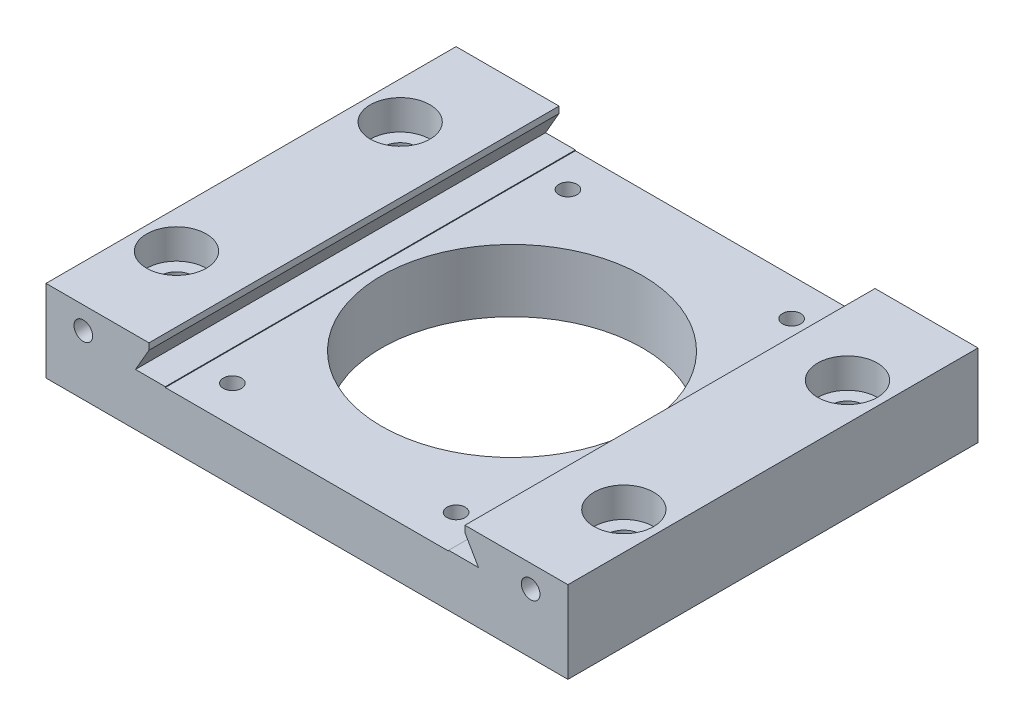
from build123d import *

# Parameters (mm, degrees)
BOSS_EXTRUDE1_DEPTH            = 35
CUT_EXTRUDE1_DEPTH             = 67.113538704
SKETCH4_W                      = 38
SKETCH4_H                      = 55
CUT_EXTRUDE3_DEPTH             = 0.1
CUT_EXTRUDE7_DEPTH             = 4.5
MIRROR2_COPY_1_DEPTH           = 4.5
SKETCH27_R                     = 19.5
BOSS_EXTRUDE2_DEPTH            = 1.5
SKETCH28_R                     = 17.5
CUT_EXTRUDE8_DEPTH             = 47.233105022
CBORE_FOR_M4_SHCS1_D           = 4.5
CBORE_FOR_M4_SHCS1_CBORE_D     = 8
CBORE_FOR_M4_SHCS1_CBORE_DEPTH = 4
CUT_EXTRUDE9_DEPTH             = 67.113538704
M3X0_5_TAPPED_HOLE2_D          = 2.5
M3X0_5_TAPPED_HOLE2_DEPTH      = 7.5
M3X0_5_TAPPED_HOLE2_TIP        = 0.751075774


with BuildPart() as part:
    # Sketch1 → Boss-Extrude1 (new, symmetric)
    with BuildSketch(Plane(origin=(0, 0, 0), x_dir=(0, 0, -1), z_dir=(1, 0, 0))):
        Polygon((0, 0), (27.5, 0), (27.5, 11), (-27.5, 11), (-27.5, 0), align=None)
    extrude(amount=BOSS_EXTRUDE1_DEPTH, both=True)

    # Sketch2 → Cut-Extrude1 (cut, through all)
    with BuildSketch(Plane.XY.offset(27.5)):
        Polygon((-20.690598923, 11), (-23, 7), (0, 7), (23, 7), (20.690598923, 11), align=None)
    extrude(amount=-CUT_EXTRUDE1_DEPTH, mode=Mode.SUBTRACT)

    # Sketch4 → Cut-Extrude3 (cut)
    with BuildSketch(Plane(origin=(0, 7, 0), x_dir=(1, 0, 0), z_dir=(0, 1, 0))):
        Rectangle(SKETCH4_W, SKETCH4_H)
    extrude(amount=-CUT_EXTRUDE3_DEPTH, mode=Mode.SUBTRACT)

    # Sketch11 → Cut-Extrude7 (cut)
    with BuildSketch(Plane.XZ):
        with BuildLine():
            Line((-13, 19.5), (-26, 19.5))
            ThreePointArc((-26, 19.5), (-29, 22.5), (-26, 25.5))
            Line((-26, 25.5), (-13, 25.5))
            ThreePointArc((-13, 25.5), (-10, 22.5), (-13, 19.5))
        make_face()
    cut_extrude7 = extrude(amount=-CUT_EXTRUDE7_DEPTH, mode=Mode.SUBTRACT)

    # Sketch22 → M3x0.5 Tapped Hole1 (revolve, cut)
    with BuildSketch(Plane(origin=(-25.5, 4.5, 22.5), x_dir=(0, 0, -1), z_dir=(1, 0, 0))):
        Polygon((0, 0), (0, 5.251075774), (1.25, 4.5), (1.25, 0), align=None)
    m3x0_5_tapped_hole1 = revolve(axis=Axis((-25.5, -1.85, 22.5), (0, 1, 0)), mode=Mode.SUBTRACT)

    # Sketch33 → 3.1 _3.1_ Diameter Hole1 (revolve, cut)
    with BuildSketch(Plane(origin=(-15, 4.5, 22.5), x_dir=(0, 0, -1), z_dir=(1, 0, 0))):
        Polygon((0, 0), (0, 3.131333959), (1.55, 2.2), (1.55, 0), align=None)
    f_3_1_3_1_diameter_hole1 = revolve(axis=Axis((-15, -1.85, 22.5), (0, 1, 0)), mode=Mode.SUBTRACT)

    # Mirror1: Cut-Extrude7, M3x0.5 Tapped Hole1, 3.1 _3.1_ Diameter Hole1 across plane
    add(cut_extrude7.mirror(Plane.XY), mode=Mode.SUBTRACT)
    add(m3x0_5_tapped_hole1.mirror(Plane.XY), mode=Mode.SUBTRACT)
    add(f_3_1_3_1_diameter_hole1.mirror(Plane.XY), mode=Mode.SUBTRACT)

    # Mirror2: Cut-Extrude7, M3x0.5 Tapped Hole1, 3.1 _3.1_ Diameter Hole1 across plane
    add(cut_extrude7.mirror(Plane(origin=(0, 0, 0), x_dir=(0, 0, 1), z_dir=(1, 0, 0))), mode=Mode.SUBTRACT)
    add(m3x0_5_tapped_hole1.mirror(Plane(origin=(0, 0, 0), x_dir=(0, 0, 1), z_dir=(1, 0, 0))), mode=Mode.SUBTRACT)
    add(f_3_1_3_1_diameter_hole1.mirror(Plane(origin=(0, 0, 0), x_dir=(0, 0, 1), z_dir=(1, 0, 0))), mode=Mode.SUBTRACT)

    # Mirror2 copy 1 sketch → Mirror2 copy 1 (cut)
    with BuildSketch(Plane(origin=(0, 0, 0), x_dir=(-1, 0, 0), z_dir=(0, -1, 0))):
        with BuildLine():
            Line((-13, 19.5), (-26, 19.5))
            ThreePointArc((-26, 19.5), (-29, 22.5), (-26, 25.5))
            Line((-26, 25.5), (-13, 25.5))
            ThreePointArc((-13, 25.5), (-10, 22.5), (-13, 19.5))
        make_face()
    extrude(amount=-MIRROR2_COPY_1_DEPTH, mode=Mode.SUBTRACT)

    # Mirror2 copy 2 sketch → Mirror2 copy 2 (revolve, cut)
    with BuildSketch(Plane(origin=(25.5, 4.5, -22.5), x_dir=(0, 0, 1), z_dir=(-1, 0, 0))):
        Polygon((0, 0), (0, 5.251075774), (1.25, 4.5), (1.25, 0), align=None)
    revolve(axis=Axis((25.5, -1.85, -22.5), (0, 1, 0)), mode=Mode.SUBTRACT)

    # Mirror2 copy 3 sketch → Mirror2 copy 3 (revolve, cut)
    with BuildSketch(Plane(origin=(15, 4.5, -22.5), x_dir=(0, 0, 1), z_dir=(-1, 0, 0))):
        Polygon((0, 0), (0, 3.131333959), (1.55, 2.2), (1.55, 0), align=None)
    revolve(axis=Axis((15, -1.85, -22.5), (0, 1, 0)), mode=Mode.SUBTRACT)

    # Sketch27 → Boss-Extrude2 (add)
    with BuildSketch(Plane.XZ):
        with Locations(Location((0, 0, 0), (0, 0, 90))):
            Circle(SKETCH27_R)
    extrude(amount=BOSS_EXTRUDE2_DEPTH)

    # Sketch28 → Cut-Extrude8 (cut, through all)
    with BuildSketch(Plane.XZ.offset(1.5)):
        with Locations(Location((0, 0, 0), (0, 0, 270))):
            Circle(SKETCH28_R)
    extrude(amount=-CUT_EXTRUDE8_DEPTH, mode=Mode.SUBTRACT)

    # CBORE for M4 SHCS1 (through all)
    with Locations(Plane(origin=(0, 11, 0), x_dir=(1, 0, 0), z_dir=(0, 1, 0))):
        with Locations((-30, 15), (-30, -15), (30, 15), (30, -15)):
            CounterBoreHole(CBORE_FOR_M4_SHCS1_D / 2, CBORE_FOR_M4_SHCS1_CBORE_D / 2, CBORE_FOR_M4_SHCS1_CBORE_DEPTH)

    # Sketch31 → Cut-Extrude9 (cut, through all)
    with BuildSketch(Plane.XY.offset(27.5)):
        Polygon((-20.690598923, 11), (-21.190598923, 11), (-21.190598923, 10.133974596), align=None)
    cut_extrude9 = extrude(amount=-CUT_EXTRUDE9_DEPTH, mode=Mode.SUBTRACT)

    # Mirror3: Cut-Extrude9 across plane
    add(cut_extrude9.mirror(Plane(origin=(0, 0, 0), x_dir=(0, 0, 1), z_dir=(1, 0, 0))), mode=Mode.SUBTRACT)

    # M3x0.5 Tapped Hole2
    with Locations(Plane.XY.offset(27.5)):
        with Locations((-30, 8), (30, 8)):
            Hole(M3X0_5_TAPPED_HOLE2_D / 2, depth=M3X0_5_TAPPED_HOLE2_DEPTH)
            with Locations((0, 0, -(M3X0_5_TAPPED_HOLE2_DEPTH + M3X0_5_TAPPED_HOLE2_TIP / 2))):  # 118° drill point
                Cone(0, M3X0_5_TAPPED_HOLE2_D / 2, M3X0_5_TAPPED_HOLE2_TIP, mode=Mode.SUBTRACT)


solid = part.part
